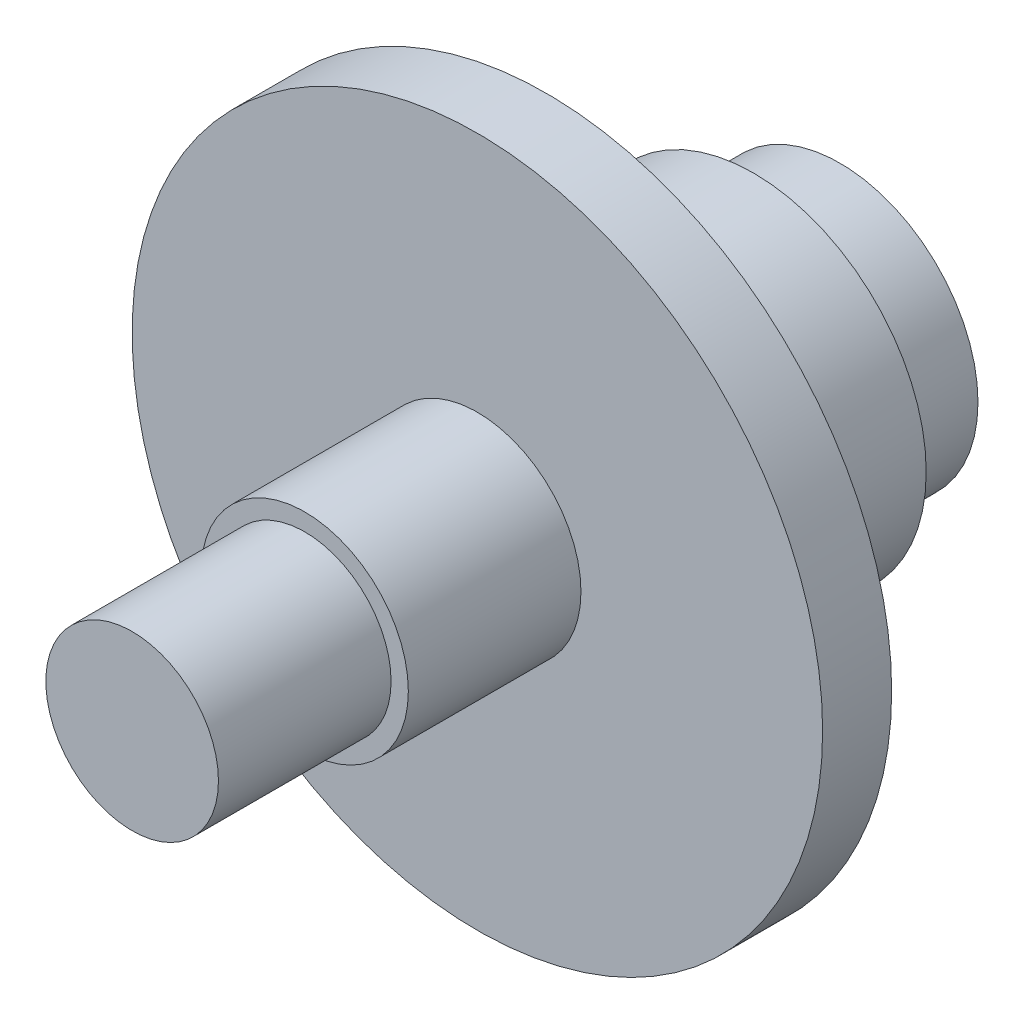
from build123d import *

# Parameters (mm, degrees)
ESQUISSE1_R           = 4
EXTRUSION1_DEPTH      = 2.5
ESQUISSE2_R           = 5
EXTRUSION2_DEPTH      = 6
ESQUISSE3_R           = 10
EXTRUSION3_DEPTH      = 2
ESQUISSE4_R           = 3
EXTRUSION4_DEPTH      = 5
ESQUISSE5_R           = 2.5
EXTRUSION5_DEPTH      = 5
TROU_TARAUD_M61_D     = 5
TROU_TARAUD_M61_DEPTH = 6
TROU_TARAUD_M61_TIP   = 1.502151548


with BuildPart() as part:
    # Esquisse1 → Extrusion1 (new body)
    with BuildSketch(Plane.XY):
        Circle(ESQUISSE1_R)
    extrude(amount=EXTRUSION1_DEPTH)

    # Esquisse2 → Extrusion2 (add)
    with BuildSketch(Plane.XY.offset(2.5)):
        Circle(ESQUISSE2_R)
    extrude(amount=EXTRUSION2_DEPTH)

    # Esquisse3 → Extrusion3 (add)
    with BuildSketch(Plane.XY.offset(8.5)):
        Circle(ESQUISSE3_R)
    extrude(amount=EXTRUSION3_DEPTH)

    # Esquisse4 → Extrusion4 (add)
    with BuildSketch(Plane.XY.offset(10.5)):
        Circle(ESQUISSE4_R)
    extrude(amount=EXTRUSION4_DEPTH)

    # Esquisse5 → Extrusion5 (add)
    with BuildSketch(Plane.XY.offset(15.5)):
        Circle(ESQUISSE5_R)
    extrude(amount=EXTRUSION5_DEPTH)

    # Trou taraud_ M61
    with Locations(Plane(origin=(0, 0, 0), x_dir=(-1, 0, 0), z_dir=(0, 0, -1))):
        with Locations((0, 0)):
            Hole(TROU_TARAUD_M61_D / 2, depth=TROU_TARAUD_M61_DEPTH)
            with Locations((0, 0, -(TROU_TARAUD_M61_DEPTH + TROU_TARAUD_M61_TIP / 2))):  # 118° drill point
                Cone(0, TROU_TARAUD_M61_D / 2, TROU_TARAUD_M61_TIP, mode=Mode.SUBTRACT)


solid = part.part
